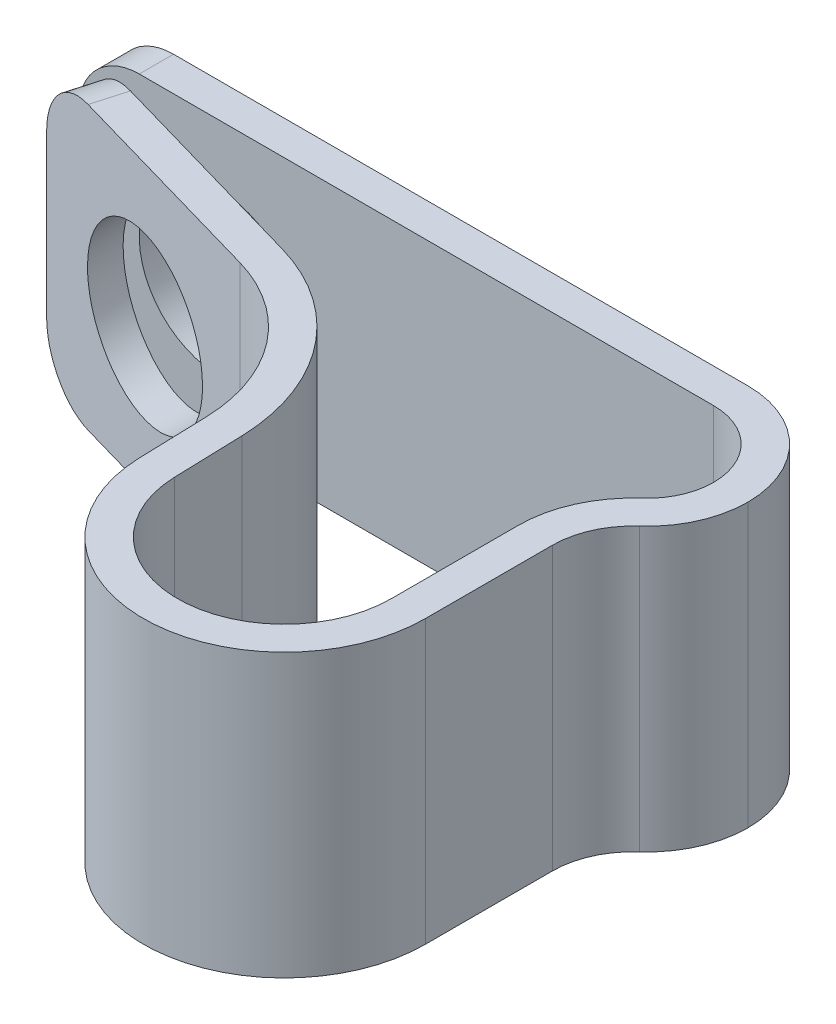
from build123d import *

# Parameters (mm, degrees)
BASE_EXTRUSION_DEPTH    = 7
CONG_1_R                = 1.5
ESQUISSE4_R             = 2
ENL_V_MAT_EXTRU_1_DEPTH = 10


with BuildPart() as part:
    # Esquisse3 → Base-Extrusion (new body)
    with BuildSketch(Plane(origin=(0, -53.254174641, 0), x_dir=(-1, 0, 0), z_dir=(0, 1, 0))):
        with BuildLine():
            Line((26.754174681, 0), (11.004174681, 0))
            ThreePointArc((11.004174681, 0), (9.236407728, 0.732233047), (8.504174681, 2.5))
            ThreePointArc((8.504174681, 2.5), (8.721893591, 3.519780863), (9.337085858, 4.361738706))
            ThreePointArc((9.337085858, 4.361738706), (9.829800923, 5.036073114), (10.004174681, 5.852828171))
            Line((10.004174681, 5.852828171), (10.004174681, 9))
            ThreePointArc((10.004174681, 9), (13.450048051, 12.499581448), (17.002500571, 9.108240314))
            Line((17.002500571, 9.108240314), (17.056087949, 7.376296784))
            ThreePointArc((17.056087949, 7.376296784), (17.897242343, 5.043624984), (19.951625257, 3.654953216))
            Line((19.951625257, 3.654953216), (26.675976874, 1.726776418))
            Line((26.675976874, 1.726776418), (26.441685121, 0.909703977))
            Line((26.441685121, 0.909703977), (19.717333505, 2.837880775))
            ThreePointArc((19.717333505, 2.837880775), (17.226394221, 4.521645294), (16.206494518, 7.35000985))
            Line((16.206494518, 7.35000985), (16.15290714, 9.081953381))
            ThreePointArc((16.15290714, 9.081953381), (13.463193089, 11.649683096), (10.854174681, 9))
            Line((10.854174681, 9), (10.854174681, 5.852828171))
            ThreePointArc((10.854174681, 5.852828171), (10.605692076, 4.688952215), (9.903573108, 3.728025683))
            ThreePointArc((9.903573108, 3.728025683), (9.497784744, 3.172659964), (9.354174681, 2.5))
            ThreePointArc((9.354174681, 2.5), (9.837448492, 1.333273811), (11.004174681, 0.85))
            Line((11.004174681, 0.85), (26.754174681, 0.85))
            Line((26.754174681, 0.85), (26.754174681, 0))
        make_face()
    extrude(amount=BASE_EXTRUSION_DEPTH)

    # Cong_1
    cong_1_edges = [part.edges().sort_by_distance(p)[0] for p in [
        (-26.754174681, -53.254174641, 0.425),
        (-26.754174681, -46.254174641, 0.425),
        (-26.558830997, -53.254174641, 1.318240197),
        (-26.558830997, -46.254174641, 1.318240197),
    ]]
    fillet(cong_1_edges, radius=CONG_1_R)

    # Esquisse4 → Enl_v. mat.-Extru.1 (cut)
    with BuildSketch(Plane(origin=(0, 0, 0), x_dir=(-1, 0, 0), z_dir=(0, 0, -1))):
        with Locations(Location((23.254174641, -49.754174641, 0), (0, 0, 90))):
            Circle(ESQUISSE4_R)
    extrude(amount=-ENL_V_MAT_EXTRU_1_DEPTH, mode=Mode.SUBTRACT)


solid = part.part
